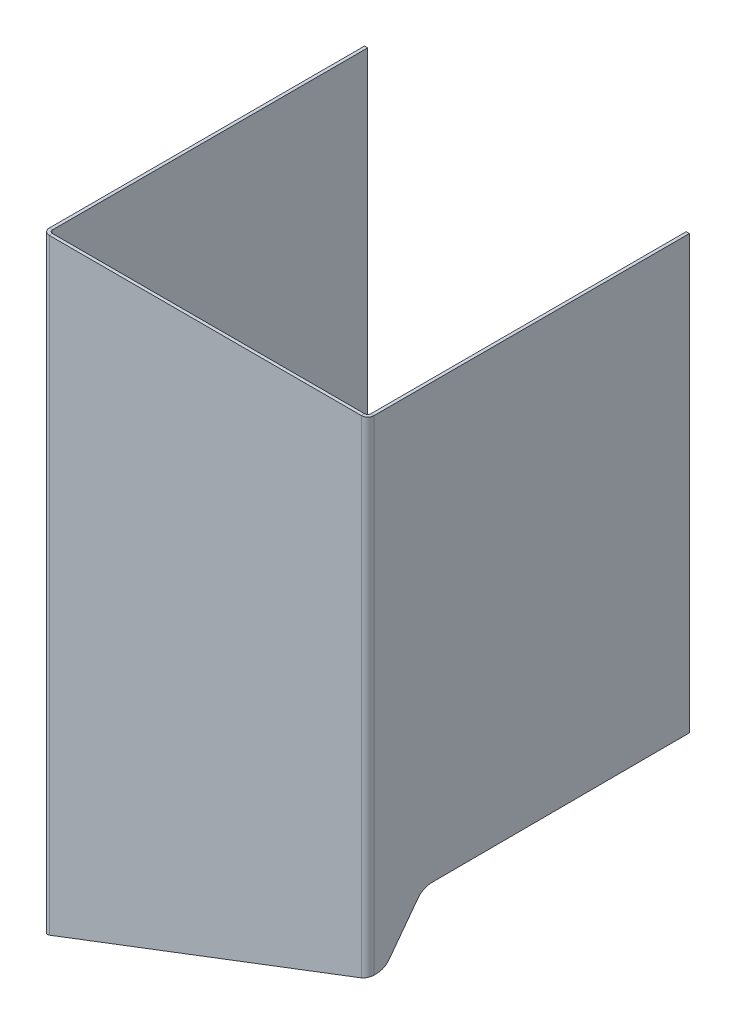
ISO-10303-21;
HEADER;
FILE_DESCRIPTION(('STEP AP214'),'2;1');
FILE_NAME('part.step','',(''),(''),'','','');
FILE_SCHEMA(('AUTOMOTIVE_DESIGN { 1 0 10303 214 1 1 1 1 }'));
ENDSEC;
DATA;
#1=APPLICATION_CONTEXT('core data for automotive mechanical design processes');
#2=APPLICATION_PROTOCOL_DEFINITION('international standard','automotive_design',2000,#1);
#3=PRODUCT_CONTEXT('',#1,'mechanical');
#4=PRODUCT('Part','Part','',(#3));
#5=PRODUCT_RELATED_PRODUCT_CATEGORY('part','',(#4));
#6=PRODUCT_DEFINITION_FORMATION('','',#4);
#7=PRODUCT_DEFINITION_CONTEXT('part definition',#1,'design');
#8=PRODUCT_DEFINITION('design','',#6,#7);
#9=PRODUCT_DEFINITION_SHAPE('','',#8);
#10=(LENGTH_UNIT() NAMED_UNIT(*) SI_UNIT(.MILLI.,.METRE.));
#11=(NAMED_UNIT(*) PLANE_ANGLE_UNIT() SI_UNIT($,.RADIAN.));
#12=(NAMED_UNIT(*) SI_UNIT($,.STERADIAN.) SOLID_ANGLE_UNIT());
#13=UNCERTAINTY_MEASURE_WITH_UNIT(LENGTH_MEASURE(1.E-05),#10,'distance_accuracy_value','');
#14=(GEOMETRIC_REPRESENTATION_CONTEXT(3) GLOBAL_UNCERTAINTY_ASSIGNED_CONTEXT((#13)) GLOBAL_UNIT_ASSIGNED_CONTEXT((#10,
#11,#12)) REPRESENTATION_CONTEXT('',''));
#15=CARTESIAN_POINT('',(0.,0.,0.));
#16=DIRECTION('',(0.,0.,1.));
#17=DIRECTION('',(1.,0.,0.));
#18=AXIS2_PLACEMENT_3D('',#15,#16,#17);
#19=CARTESIAN_POINT('',(98.,500.,2.));
#20=DIRECTION('',(0.,1.,0.));
#21=DIRECTION('',(0.,0.,1.));
#22=AXIS2_PLACEMENT_3D('',#19,#20,#21);
#23=PLANE('',#22);
#24=DIRECTION('',(0.,0.,-1.));
#25=VECTOR('',#24,1.);
#26=CARTESIAN_POINT('',(100.,500.,0.));
#27=LINE('',#26,#25);
#28=CARTESIAN_POINT('',(100.,500.,-2.));
#29=VERTEX_POINT('',#28);
#30=CARTESIAN_POINT('',(100.,500.,-200.));
#31=VERTEX_POINT('',#30);
#32=EDGE_CURVE('E249',#29,#31,#27,.T.);
#33=ORIENTED_EDGE('',*,*,#32,.F.);
#34=DIRECTION('',(1.,0.,0.));
#35=VECTOR('',#34,1.);
#36=CARTESIAN_POINT('',(100.,500.,-2.));
#37=LINE('',#36,#35);
#38=CARTESIAN_POINT('',(102.,500.,-2.));
#39=VERTEX_POINT('',#38);
#40=EDGE_CURVE('E55',#29,#39,#37,.T.);
#41=ORIENTED_EDGE('',*,*,#40,.T.);
#42=DIRECTION('',(0.,0.,-1.));
#43=VECTOR('',#42,1.);
#44=CARTESIAN_POINT('',(102.,500.,0.));
#45=LINE('',#44,#43);
#46=CARTESIAN_POINT('',(102.,500.,-200.));
#47=VERTEX_POINT('',#46);
#48=EDGE_CURVE('E244',#39,#47,#45,.T.);
#49=ORIENTED_EDGE('',*,*,#48,.T.);
#50=DIRECTION('',(1.,0.,0.));
#51=VECTOR('',#50,1.);
#52=CARTESIAN_POINT('',(100.,500.,-200.));
#53=LINE('',#52,#51);
#54=EDGE_CURVE('E246',#31,#47,#53,.T.);
#55=ORIENTED_EDGE('',*,*,#54,.F.);
#56=EDGE_LOOP('',(#33,#41,#49,#55));
#57=FACE_BOUND('',#56,.T.);
#58=ADVANCED_FACE('F32',(#57),#23,.T.);
#59=CARTESIAN_POINT('',(98.,500.,-2.));
#60=DIRECTION('',(0.,-1.,0.));
#61=DIRECTION('',(0.,0.,-1.));
#62=AXIS2_PLACEMENT_3D('',#59,#60,#61);
#63=PLANE('',#62);
#64=DIRECTION('',(0.,0.,1.));
#65=VECTOR('',#64,1.);
#66=CARTESIAN_POINT('',(-102.,500.,-200.));
#67=LINE('',#66,#65);
#68=CARTESIAN_POINT('',(-102.,500.,-200.));
#69=VERTEX_POINT('',#68);
#70=CARTESIAN_POINT('',(-102.,500.,-2.));
#71=VERTEX_POINT('',#70);
#72=EDGE_CURVE('E267',#69,#71,#67,.T.);
#73=ORIENTED_EDGE('',*,*,#72,.T.);
#74=DIRECTION('',(1.,0.,0.));
#75=VECTOR('',#74,1.);
#76=CARTESIAN_POINT('',(-102.,500.,-2.));
#77=LINE('',#76,#75);
#78=CARTESIAN_POINT('',(-100.,500.,-2.));
#79=VERTEX_POINT('',#78);
#80=EDGE_CURVE('E315',#71,#79,#77,.T.);
#81=ORIENTED_EDGE('',*,*,#80,.T.);
#82=DIRECTION('',(0.,0.,1.));
#83=VECTOR('',#82,1.);
#84=CARTESIAN_POINT('',(-100.,500.,-200.));
#85=LINE('',#84,#83);
#86=CARTESIAN_POINT('',(-100.,500.,-200.));
#87=VERTEX_POINT('',#86);
#88=EDGE_CURVE('E261',#87,#79,#85,.T.);
#89=ORIENTED_EDGE('',*,*,#88,.F.);
#90=DIRECTION('',(1.,0.,0.));
#91=VECTOR('',#90,1.);
#92=CARTESIAN_POINT('',(-102.,500.,-200.));
#93=LINE('',#92,#91);
#94=EDGE_CURVE('E264',#69,#87,#93,.T.);
#95=ORIENTED_EDGE('',*,*,#94,.F.);
#96=EDGE_LOOP('',(#73,#81,#89,#95));
#97=FACE_BOUND('',#96,.T.);
#98=ADVANCED_FACE('F375',(#97),#63,.F.);
#99=CARTESIAN_POINT('',(-98.,500.,0.));
#100=DIRECTION('',(0.,1.,0.));
#101=DIRECTION('',(0.,0.,1.));
#102=AXIS2_PLACEMENT_3D('',#99,#100,#101);
#103=PLANE('',#102);
#104=DIRECTION('',(0.,0.,1.));
#105=VECTOR('',#104,1.);
#106=CARTESIAN_POINT('',(-98.,500.,0.));
#107=LINE('',#106,#105);
#108=CARTESIAN_POINT('',(-98.,500.,0.));
#109=VERTEX_POINT('',#108);
#110=CARTESIAN_POINT('',(-98.,500.,2.));
#111=VERTEX_POINT('',#110);
#112=EDGE_CURVE('E317',#109,#111,#107,.T.);
#113=ORIENTED_EDGE('',*,*,#112,.F.);
#114=CARTESIAN_POINT('',(-98.,500.,-2.));
#115=DIRECTION('',(0.,-1.,0.));
#116=DIRECTION('',(0.,0.,-1.));
#117=AXIS2_PLACEMENT_3D('',#114,#115,#116);
#118=CIRCLE('',#117,2.);
#119=EDGE_CURVE('E258',#79,#109,#118,.F.);
#120=ORIENTED_EDGE('',*,*,#119,.F.);
#121=ORIENTED_EDGE('',*,*,#80,.F.);
#122=CARTESIAN_POINT('',(-98.,500.,-2.));
#123=DIRECTION('',(0.,1.,0.));
#124=DIRECTION('',(1.,0.,0.));
#125=AXIS2_PLACEMENT_3D('',#122,#123,#124);
#126=CIRCLE('',#125,4.);
#127=EDGE_CURVE('E270',#71,#111,#126,.T.);
#128=ORIENTED_EDGE('',*,*,#127,.T.);
#129=EDGE_LOOP('',(#113,#120,#121,#128));
#130=FACE_BOUND('',#129,.T.);
#131=ADVANCED_FACE('F34',(#130),#103,.T.);
#132=CARTESIAN_POINT('',(-102.,500.,-2.));
#133=DIRECTION('',(0.,1.,0.));
#134=DIRECTION('',(0.,0.,1.));
#135=AXIS2_PLACEMENT_3D('',#132,#133,#134);
#136=PLANE('',#135);
#137=DIRECTION('',(1.,0.,0.));
#138=VECTOR('',#137,1.);
#139=CARTESIAN_POINT('',(-100.,500.,0.));
#140=LINE('',#139,#138);
#141=CARTESIAN_POINT('',(98.,500.,0.));
#142=VERTEX_POINT('',#141);
#143=EDGE_CURVE('E255',#109,#142,#140,.T.);
#144=ORIENTED_EDGE('',*,*,#143,.F.);
#145=ORIENTED_EDGE('',*,*,#112,.T.);
#146=DIRECTION('',(1.,0.,0.));
#147=VECTOR('',#146,1.);
#148=CARTESIAN_POINT('',(-100.,500.,2.));
#149=LINE('',#148,#147);
#150=CARTESIAN_POINT('',(98.,500.,2.));
#151=VERTEX_POINT('',#150);
#152=EDGE_CURVE('E273',#111,#151,#149,.T.);
#153=ORIENTED_EDGE('',*,*,#152,.T.);
#154=DIRECTION('',(0.,0.,-1.));
#155=VECTOR('',#154,1.);
#156=CARTESIAN_POINT('',(98.,500.,2.));
#157=LINE('',#156,#155);
#158=EDGE_CURVE('E312',#151,#142,#157,.T.);
#159=ORIENTED_EDGE('',*,*,#158,.T.);
#160=EDGE_LOOP('',(#144,#145,#153,#159));
#161=FACE_BOUND('',#160,.T.);
#162=ADVANCED_FACE('F425',(#161),#136,.T.);
#163=CARTESIAN_POINT('',(100.,500.,-2.));
#164=DIRECTION('',(0.,1.,0.));
#165=DIRECTION('',(0.,0.,1.));
#166=AXIS2_PLACEMENT_3D('',#163,#164,#165);
#167=PLANE('',#166);
#168=ORIENTED_EDGE('',*,*,#40,.F.);
#169=CARTESIAN_POINT('',(98.,500.,-2.));
#170=DIRECTION('',(0.,-1.,0.));
#171=DIRECTION('',(0.,0.,-1.));
#172=AXIS2_PLACEMENT_3D('',#169,#170,#171);
#173=CIRCLE('',#172,2.);
#174=EDGE_CURVE('E252',#142,#29,#173,.F.);
#175=ORIENTED_EDGE('',*,*,#174,.F.);
#176=ORIENTED_EDGE('',*,*,#158,.F.);
#177=CARTESIAN_POINT('',(98.,500.,-2.));
#178=DIRECTION('',(0.,1.,0.));
#179=DIRECTION('',(1.,0.,0.));
#180=AXIS2_PLACEMENT_3D('',#177,#178,#179);
#181=CIRCLE('',#180,4.);
#182=EDGE_CURVE('E276',#151,#39,#181,.T.);
#183=ORIENTED_EDGE('',*,*,#182,.T.);
#184=EDGE_LOOP('',(#168,#175,#176,#183));
#185=FACE_BOUND('',#184,.T.);
#186=ADVANCED_FACE('F386',(#185),#167,.T.);
#187=CARTESIAN_POINT('',(98.,500.,-2.));
#188=DIRECTION('',(0.,-1.,0.));
#189=DIRECTION('',(0.,0.,-1.));
#190=AXIS2_PLACEMENT_3D('',#187,#188,#189);
#191=CYLINDRICAL_SURFACE('',#190,4.);
#192=CARTESIAN_POINT('',(98.,194.144163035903,-2.));
#193=DIRECTION('',(0.35630890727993,-0.934363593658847,-0.00293895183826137));
#194=DIRECTION('',(-0.934331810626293,-0.356321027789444,0.00770667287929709));
#195=AXIS2_PLACEMENT_3D('',#192,#193,#194);
#196=ELLIPSE('',#195,4.28098871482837,4.);
#197=CARTESIAN_POINT('',(102.,195.669517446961,-2.));
#198=VERTEX_POINT('',#197);
#199=CARTESIAN_POINT('',(98.,194.13158141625,2.));
#200=VERTEX_POINT('',#199);
#201=EDGE_CURVE('E319',#198,#200,#196,.T.);
#202=ORIENTED_EDGE('',*,*,#201,.F.);
#203=DIRECTION('',(0.,-1.,0.));
#204=VECTOR('',#203,1.);
#205=CARTESIAN_POINT('',(102.,500.,-2.));
#206=LINE('',#205,#204);
#207=EDGE_CURVE('E191',#39,#198,#206,.T.);
#208=ORIENTED_EDGE('',*,*,#207,.F.);
#209=ORIENTED_EDGE('',*,*,#182,.F.);
#210=DIRECTION('',(0.,-1.,0.));
#211=VECTOR('',#210,1.);
#212=CARTESIAN_POINT('',(98.,500.,2.));
#213=LINE('',#212,#211);
#214=EDGE_CURVE('E279',#151,#200,#213,.T.);
#215=ORIENTED_EDGE('',*,*,#214,.T.);
#216=EDGE_LOOP('',(#202,#208,#209,#215));
#217=FACE_BOUND('',#216,.T.);
#218=ADVANCED_FACE('F424',(#217),#191,.T.);
#219=CARTESIAN_POINT('',(-100.,500.,2.));
#220=DIRECTION('',(0.,0.,-1.));
#221=DIRECTION('',(-1.,0.,0.));
#222=AXIS2_PLACEMENT_3D('',#219,#220,#221);
#223=PLANE('',#222);
#224=DIRECTION('',(-0.934367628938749,-0.35631044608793,0.));
#225=VECTOR('',#224,1.);
#226=CARTESIAN_POINT('',(26.9687394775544,167.044619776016,2.));
#227=LINE('',#226,#225);
#228=CARTESIAN_POINT('',(-98.,119.389215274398,2.));
#229=VERTEX_POINT('',#228);
#230=EDGE_CURVE('E359',#200,#229,#227,.T.);
#231=ORIENTED_EDGE('',*,*,#230,.F.);
#232=ORIENTED_EDGE('',*,*,#214,.F.);
#233=ORIENTED_EDGE('',*,*,#152,.F.);
#234=DIRECTION('',(0.,-1.,0.));
#235=VECTOR('',#234,1.);
#236=CARTESIAN_POINT('',(-98.,500.,2.));
#237=LINE('',#236,#235);
#238=EDGE_CURVE('E282',#111,#229,#237,.T.);
#239=ORIENTED_EDGE('',*,*,#238,.T.);
#240=EDGE_LOOP('',(#231,#232,#233,#239));
#241=FACE_BOUND('',#240,.T.);
#242=ADVANCED_FACE('F433',(#241),#223,.F.);
#243=CARTESIAN_POINT('',(-98.,500.,-2.));
#244=DIRECTION('',(0.,-1.,0.));
#245=DIRECTION('',(0.,0.,-1.));
#246=AXIS2_PLACEMENT_3D('',#243,#244,#245);
#247=CYLINDRICAL_SURFACE('',#246,4.);
#248=CARTESIAN_POINT('',(-98.,119.401796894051,-2.));
#249=DIRECTION('',(0.35630890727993,-0.934363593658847,-0.00293895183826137));
#250=DIRECTION('',(-0.934331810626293,-0.356321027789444,0.00770667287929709));
#251=AXIS2_PLACEMENT_3D('',#248,#249,#250);
#252=ELLIPSE('',#251,4.28098871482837,4.);
#253=CARTESIAN_POINT('',(-102.,117.876442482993,-2.));
#254=VERTEX_POINT('',#253);
#255=EDGE_CURVE('E198',#229,#254,#252,.T.);
#256=ORIENTED_EDGE('',*,*,#255,.F.);
#257=ORIENTED_EDGE('',*,*,#238,.F.);
#258=ORIENTED_EDGE('',*,*,#127,.F.);
#259=DIRECTION('',(0.,-1.,0.));
#260=VECTOR('',#259,1.);
#261=CARTESIAN_POINT('',(-102.,500.,-2.));
#262=LINE('',#261,#260);
#263=EDGE_CURVE('E285',#71,#254,#262,.T.);
#264=ORIENTED_EDGE('',*,*,#263,.T.);
#265=EDGE_LOOP('',(#256,#257,#258,#264));
#266=FACE_BOUND('',#265,.T.);
#267=ADVANCED_FACE('F368',(#266),#247,.T.);
#268=CARTESIAN_POINT('',(-102.,500.,-200.));
#269=DIRECTION('',(1.,0.,0.));
#270=DIRECTION('',(0.,0.,-1.));
#271=AXIS2_PLACEMENT_3D('',#268,#269,#270);
#272=PLANE('',#271);
#273=DIRECTION('',(0.,0.00314538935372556,-0.999995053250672));
#274=VECTOR('',#273,1.);
#275=CARTESIAN_POINT('',(-102.,118.503007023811,-201.199962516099));
#276=LINE('',#275,#274);
#277=CARTESIAN_POINT('',(-102.,118.232611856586,-115.234824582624));
#278=VERTEX_POINT('',#277);
#279=EDGE_CURVE('E193',#254,#278,#276,.T.);
#280=ORIENTED_EDGE('',*,*,#279,.F.);
#281=ORIENTED_EDGE('',*,*,#263,.F.);
#282=ORIENTED_EDGE('',*,*,#72,.F.);
#283=DIRECTION('',(0.,-1.,0.));
#284=VECTOR('',#283,1.);
#285=CARTESIAN_POINT('',(-102.,500.,-200.));
#286=LINE('',#285,#284);
#287=CARTESIAN_POINT('',(-102.,150.60664801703,-200.));
#288=VERTEX_POINT('',#287);
#289=EDGE_CURVE('E288',#69,#288,#286,.T.);
#290=ORIENTED_EDGE('',*,*,#289,.T.);
#291=DIRECTION('',(0.,0.00314538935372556,-0.999995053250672));
#292=VECTOR('',#291,1.);
#293=CARTESIAN_POINT('',(-102.,150.610104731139,-201.09897269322));
#294=LINE('',#293,#292);
#295=CARTESIAN_POINT('',(-102.,150.450613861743,-150.392982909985));
#296=VERTEX_POINT('',#295);
#297=EDGE_CURVE('E11',#296,#288,#294,.T.);
#298=ORIENTED_EDGE('',*,*,#297,.F.);
#299=CARTESIAN_POINT('',(-102.,137.615118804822,-152.768221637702));
#300=DIRECTION('',(1.,0.,0.));
#301=DIRECTION('',(0.,-0.569957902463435,-0.82167389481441));
#302=AXIS2_PLACEMENT_3D('',#299,#300,#301);
#303=ELLIPSE('',#302,14.418063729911,12.);
#304=CARTESIAN_POINT('',(-102.,146.125248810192,-141.132044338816));
#305=VERTEX_POINT('',#304);
#306=EDGE_CURVE('E40',#305,#296,#303,.F.);
#307=ORIENTED_EDGE('',*,*,#306,.F.);
#308=DIRECTION('',(0.,0.800574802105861,-0.59923283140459));
#309=VECTOR('',#308,1.);
#310=CARTESIAN_POINT('',(-102.,401.1714251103,-332.034933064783));
#311=LINE('',#310,#309);
#312=CARTESIAN_POINT('',(-102.,121.837082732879,-122.95227339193));
#313=VERTEX_POINT('',#312);
#314=EDGE_CURVE('E323',#313,#305,#311,.T.);
#315=ORIENTED_EDGE('',*,*,#314,.F.);
#316=CARTESIAN_POINT('',(-102.,128.928857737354,-113.255458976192));
#317=DIRECTION('',(1.,0.,0.));
#318=DIRECTION('',(0.,-0.569957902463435,-0.82167389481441));
#319=AXIS2_PLACEMENT_3D('',#316,#317,#318);
#320=ELLIPSE('',#319,12.0150531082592,10.);
#321=EDGE_CURVE('E321',#278,#313,#320,.T.);
#322=ORIENTED_EDGE('',*,*,#321,.F.);
#323=EDGE_LOOP('',(#280,#281,#282,#290,#298,#307,#315,#322));
#324=FACE_BOUND('',#323,.T.);
#325=ADVANCED_FACE('F342',(#324),#272,.F.);
#326=CARTESIAN_POINT('',(-102.,500.,-200.));
#327=DIRECTION('',(0.,0.,-1.));
#328=DIRECTION('',(-1.,0.,0.));
#329=AXIS2_PLACEMENT_3D('',#326,#327,#328);
#330=PLANE('',#329);
#331=DIRECTION('',(0.,-1.,0.));
#332=VECTOR('',#331,1.);
#333=CARTESIAN_POINT('',(-100.,500.,-200.));
#334=LINE('',#333,#332);
#335=CARTESIAN_POINT('',(-100.,151.369325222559,-200.));
#336=VERTEX_POINT('',#335);
#337=EDGE_CURVE('E291',#87,#336,#334,.T.);
#338=ORIENTED_EDGE('',*,*,#337,.T.);
#339=DIRECTION('',(-0.934367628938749,-0.35631044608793,0.));
#340=VECTOR('',#339,1.);
#341=CARTESIAN_POINT('',(14.321763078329,194.964626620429,-200.));
#342=LINE('',#341,#340);
#343=EDGE_CURVE('E230',#336,#288,#342,.T.);
#344=ORIENTED_EDGE('',*,*,#343,.T.);
#345=ORIENTED_EDGE('',*,*,#289,.F.);
#346=ORIENTED_EDGE('',*,*,#94,.T.);
#347=EDGE_LOOP('',(#338,#344,#345,#346));
#348=FACE_BOUND('',#347,.T.);
#349=ADVANCED_FACE('F347',(#348),#330,.T.);
#350=CARTESIAN_POINT('',(-100.,500.,-200.));
#351=DIRECTION('',(1.,0.,0.));
#352=DIRECTION('',(0.,0.,-1.));
#353=AXIS2_PLACEMENT_3D('',#350,#351,#352);
#354=PLANE('',#353);
#355=DIRECTION('',(0.,-1.,0.));
#356=VECTOR('',#355,1.);
#357=CARTESIAN_POINT('',(-100.,500.,-2.));
#358=LINE('',#357,#356);
#359=CARTESIAN_POINT('',(-100.,118.639119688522,-2.));
#360=VERTEX_POINT('',#359);
#361=EDGE_CURVE('E294',#79,#360,#358,.T.);
#362=ORIENTED_EDGE('',*,*,#361,.T.);
#363=DIRECTION('',(0.,0.00314538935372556,-0.999995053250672));
#364=VECTOR('',#363,1.);
#365=CARTESIAN_POINT('',(-100.,119.265676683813,-201.197563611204));
#366=LINE('',#365,#364);
#367=CARTESIAN_POINT('',(-100.,118.991846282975,-114.140282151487));
#368=VERTEX_POINT('',#367);
#369=EDGE_CURVE('E192',#360,#368,#366,.T.);
#370=ORIENTED_EDGE('',*,*,#369,.T.);
#371=CARTESIAN_POINT('',(-100.,129.688092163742,-112.160916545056));
#372=DIRECTION('',(1.,0.,0.));
#373=DIRECTION('',(0.,-0.569957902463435,-0.82167389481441));
#374=AXIS2_PLACEMENT_3D('',#371,#372,#373);
#375=ELLIPSE('',#374,12.0150531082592,10.);
#376=CARTESIAN_POINT('',(-100.,122.596317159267,-121.857730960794));
#377=VERTEX_POINT('',#376);
#378=EDGE_CURVE('E211',#368,#377,#375,.T.);
#379=ORIENTED_EDGE('',*,*,#378,.T.);
#380=DIRECTION('',(0.,0.800574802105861,-0.59923283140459));
#381=VECTOR('',#380,1.);
#382=CARTESIAN_POINT('',(-100.,401.969136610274,-330.969190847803));
#383=LINE('',#382,#381);
#384=CARTESIAN_POINT('',(-100.,146.88448323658,-140.03750190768));
#385=VERTEX_POINT('',#384);
#386=EDGE_CURVE('E178',#377,#385,#383,.T.);
#387=ORIENTED_EDGE('',*,*,#386,.T.);
#388=CARTESIAN_POINT('',(-100.,138.374353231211,-151.673679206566));
#389=DIRECTION('',(1.,0.,0.));
#390=DIRECTION('',(0.,-0.569957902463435,-0.82167389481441));
#391=AXIS2_PLACEMENT_3D('',#388,#389,#390);
#392=ELLIPSE('',#391,14.418063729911,12.);
#393=CARTESIAN_POINT('',(-100.,151.209848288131,-149.298440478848));
#394=VERTEX_POINT('',#393);
#395=EDGE_CURVE('E222',#385,#394,#392,.F.);
#396=ORIENTED_EDGE('',*,*,#395,.T.);
#397=DIRECTION('',(0.,0.00314538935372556,-0.999995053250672));
#398=VECTOR('',#397,1.);
#399=CARTESIAN_POINT('',(-100.,151.37277439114,-201.096573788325));
#400=LINE('',#399,#398);
#401=EDGE_CURVE('E233',#394,#336,#400,.T.);
#402=ORIENTED_EDGE('',*,*,#401,.T.);
#403=ORIENTED_EDGE('',*,*,#337,.F.);
#404=ORIENTED_EDGE('',*,*,#88,.T.);
#405=EDGE_LOOP('',(#362,#370,#379,#387,#396,#402,#403,#404));
#406=FACE_BOUND('',#405,.T.);
#407=ADVANCED_FACE('F349',(#406),#354,.T.);
#408=CARTESIAN_POINT('',(-98.,500.,-2.));
#409=DIRECTION('',(0.,-1.,0.));
#410=DIRECTION('',(0.,0.,-1.));
#411=AXIS2_PLACEMENT_3D('',#408,#409,#410);
#412=CYLINDRICAL_SURFACE('',#411,2.);
#413=DIRECTION('',(0.,-1.,0.));
#414=VECTOR('',#413,1.);
#415=CARTESIAN_POINT('',(-98.,500.,0.));
#416=LINE('',#415,#414);
#417=CARTESIAN_POINT('',(-98.,119.395506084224,0.));
#418=VERTEX_POINT('',#417);
#419=EDGE_CURVE('E297',#109,#418,#416,.T.);
#420=ORIENTED_EDGE('',*,*,#419,.T.);
#421=CARTESIAN_POINT('',(-98.,119.401796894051,-2.));
#422=DIRECTION('',(0.35630890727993,-0.934363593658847,-0.00293895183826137));
#423=DIRECTION('',(-0.934331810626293,-0.356321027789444,0.00770667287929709));
#424=AXIS2_PLACEMENT_3D('',#421,#422,#423);
#425=ELLIPSE('',#424,2.14049435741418,2.);
#426=EDGE_CURVE('E196',#418,#360,#425,.T.);
#427=ORIENTED_EDGE('',*,*,#426,.T.);
#428=ORIENTED_EDGE('',*,*,#361,.F.);
#429=ORIENTED_EDGE('',*,*,#119,.T.);
#430=EDGE_LOOP('',(#420,#427,#428,#429));
#431=FACE_BOUND('',#430,.T.);
#432=ADVANCED_FACE('F377',(#431),#412,.F.);
#433=CARTESIAN_POINT('',(-100.,500.,0.));
#434=DIRECTION('',(0.,0.,-1.));
#435=DIRECTION('',(-1.,0.,0.));
#436=AXIS2_PLACEMENT_3D('',#433,#434,#435);
#437=PLANE('',#436);
#438=DIRECTION('',(0.,-1.,0.));
#439=VECTOR('',#438,1.);
#440=CARTESIAN_POINT('',(98.,500.,0.));
#441=LINE('',#440,#439);
#442=CARTESIAN_POINT('',(98.,194.137872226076,0.));
#443=VERTEX_POINT('',#442);
#444=EDGE_CURVE('E300',#142,#443,#441,.T.);
#445=ORIENTED_EDGE('',*,*,#444,.T.);
#446=DIRECTION('',(-0.934367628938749,-0.35631044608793,0.));
#447=VECTOR('',#446,1.);
#448=CARTESIAN_POINT('',(26.9666451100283,167.050111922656,0.));
#449=LINE('',#448,#447);
#450=EDGE_CURVE('E204',#443,#418,#449,.T.);
#451=ORIENTED_EDGE('',*,*,#450,.T.);
#452=ORIENTED_EDGE('',*,*,#419,.F.);
#453=ORIENTED_EDGE('',*,*,#143,.T.);
#454=EDGE_LOOP('',(#445,#451,#452,#453));
#455=FACE_BOUND('',#454,.T.);
#456=ADVANCED_FACE('F379',(#455),#437,.T.);
#457=CARTESIAN_POINT('',(98.,500.,-2.));
#458=DIRECTION('',(0.,-1.,0.));
#459=DIRECTION('',(0.,0.,-1.));
#460=AXIS2_PLACEMENT_3D('',#457,#458,#459);
#461=CYLINDRICAL_SURFACE('',#460,2.);
#462=DIRECTION('',(0.,-1.,0.));
#463=VECTOR('',#462,1.);
#464=CARTESIAN_POINT('',(100.,500.,-2.));
#465=LINE('',#464,#463);
#466=CARTESIAN_POINT('',(100.,194.906840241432,-2.));
#467=VERTEX_POINT('',#466);
#468=EDGE_CURVE('E303',#29,#467,#465,.T.);
#469=ORIENTED_EDGE('',*,*,#468,.T.);
#470=CARTESIAN_POINT('',(98.,194.144163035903,-2.));
#471=DIRECTION('',(0.35630890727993,-0.934363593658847,-0.00293895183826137));
#472=DIRECTION('',(-0.934331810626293,-0.356321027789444,0.00770667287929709));
#473=AXIS2_PLACEMENT_3D('',#470,#471,#472);
#474=ELLIPSE('',#473,2.14049435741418,2.);
#475=EDGE_CURVE('E207',#467,#443,#474,.T.);
#476=ORIENTED_EDGE('',*,*,#475,.T.);
#477=ORIENTED_EDGE('',*,*,#444,.F.);
#478=ORIENTED_EDGE('',*,*,#174,.T.);
#479=EDGE_LOOP('',(#469,#476,#477,#478));
#480=FACE_BOUND('',#479,.T.);
#481=ADVANCED_FACE('F384',(#480),#461,.F.);
#482=CARTESIAN_POINT('',(100.,500.,0.));
#483=DIRECTION('',(-1.,0.,0.));
#484=DIRECTION('',(0.,0.,1.));
#485=AXIS2_PLACEMENT_3D('',#482,#483,#484);
#486=PLANE('',#485);
#487=CARTESIAN_POINT('',(100.,205.611534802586,-2.70667343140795));
#488=DIRECTION('',(-1.,0.,0.));
#489=DIRECTION('',(0.,-0.569957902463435,-0.82167389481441));
#490=AXIS2_PLACEMENT_3D('',#487,#488,#489);
#491=ELLIPSE('',#490,12.0150531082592,10.);
#492=CARTESIAN_POINT('',(100.,198.519759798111,-12.4034878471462));
#493=VERTEX_POINT('',#492);
#494=CARTESIAN_POINT('',(100.,194.915288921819,-4.68603903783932));
#495=VERTEX_POINT('',#494);
#496=EDGE_CURVE('E179',#493,#495,#491,.T.);
#497=ORIENTED_EDGE('',*,*,#496,.T.);
#498=DIRECTION('',(0.,-0.00314538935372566,0.999995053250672));
#499=VECTOR('',#498,1.);
#500=CARTESIAN_POINT('',(100.,194.903567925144,-0.959651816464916));
#501=LINE('',#500,#499);
#502=EDGE_CURVE('E183',#495,#467,#501,.T.);
#503=ORIENTED_EDGE('',*,*,#502,.T.);
#504=ORIENTED_EDGE('',*,*,#468,.F.);
#505=ORIENTED_EDGE('',*,*,#32,.T.);
#506=DIRECTION('',(0.,-1.,0.));
#507=VECTOR('',#506,1.);
#508=CARTESIAN_POINT('',(100.,500.,-200.));
#509=LINE('',#508,#507);
#510=CARTESIAN_POINT('',(100.,227.637045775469,-200.));
#511=VERTEX_POINT('',#510);
#512=EDGE_CURVE('E306',#31,#511,#509,.T.);
#513=ORIENTED_EDGE('',*,*,#512,.T.);
#514=DIRECTION('',(0.,-0.00314538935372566,0.999995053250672));
#515=VECTOR('',#514,1.);
#516=CARTESIAN_POINT('',(100.,227.010665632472,-0.858661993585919));
#517=LINE('',#516,#515);
#518=CARTESIAN_POINT('',(100.,227.133290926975,-39.8441973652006));
#519=VERTEX_POINT('',#518);
#520=EDGE_CURVE('E236',#511,#519,#517,.T.);
#521=ORIENTED_EDGE('',*,*,#520,.T.);
#522=CARTESIAN_POINT('',(100.,214.297795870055,-42.2194360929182));
#523=DIRECTION('',(-1.,0.,0.));
#524=DIRECTION('',(0.,-0.569957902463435,-0.82167389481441));
#525=AXIS2_PLACEMENT_3D('',#522,#523,#524);
#526=ELLIPSE('',#525,14.418063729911,12.);
#527=CARTESIAN_POINT('',(100.,222.807925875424,-30.5832587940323));
#528=VERTEX_POINT('',#527);
#529=EDGE_CURVE('E225',#519,#528,#526,.F.);
#530=ORIENTED_EDGE('',*,*,#529,.T.);
#531=DIRECTION('',(0.,-0.800574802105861,0.59923283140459));
#532=VECTOR('',#531,1.);
#533=CARTESIAN_POINT('',(100.,385.794145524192,-152.578971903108));
#534=LINE('',#533,#532);
#535=EDGE_CURVE('E217',#528,#493,#534,.T.);
#536=ORIENTED_EDGE('',*,*,#535,.T.);
#537=EDGE_LOOP('',(#497,#503,#504,#505,#513,#521,#530,#536));
#538=FACE_BOUND('',#537,.T.);
#539=ADVANCED_FACE('F390',(#538),#486,.T.);
#540=CARTESIAN_POINT('',(100.,500.,-200.));
#541=DIRECTION('',(0.,0.,-1.));
#542=DIRECTION('',(-1.,0.,0.));
#543=AXIS2_PLACEMENT_3D('',#540,#541,#542);
#544=PLANE('',#543);
#545=DIRECTION('',(0.,-1.,0.));
#546=VECTOR('',#545,1.);
#547=CARTESIAN_POINT('',(102.,500.,-200.));
#548=LINE('',#547,#546);
#549=CARTESIAN_POINT('',(102.,228.399722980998,-200.));
#550=VERTEX_POINT('',#549);
#551=EDGE_CURVE('E309',#47,#550,#548,.T.);
#552=ORIENTED_EDGE('',*,*,#551,.T.);
#553=DIRECTION('',(-0.934367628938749,-0.35631044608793,0.));
#554=VECTOR('',#553,1.);
#555=CARTESIAN_POINT('',(190.67642201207,262.215465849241,-200.));
#556=LINE('',#555,#554);
#557=EDGE_CURVE('E239',#550,#511,#556,.T.);
#558=ORIENTED_EDGE('',*,*,#557,.T.);
#559=ORIENTED_EDGE('',*,*,#512,.F.);
#560=ORIENTED_EDGE('',*,*,#54,.T.);
#561=EDGE_LOOP('',(#552,#558,#559,#560));
#562=FACE_BOUND('',#561,.T.);
#563=ADVANCED_FACE('F394',(#562),#544,.T.);
#564=CARTESIAN_POINT('',(102.,500.,0.));
#565=DIRECTION('',(-1.,0.,0.));
#566=DIRECTION('',(0.,0.,1.));
#567=AXIS2_PLACEMENT_3D('',#564,#565,#566);
#568=PLANE('',#567);
#569=DIRECTION('',(0.,-0.00314538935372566,0.999995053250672));
#570=VECTOR('',#569,1.);
#571=CARTESIAN_POINT('',(102.,195.666237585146,-0.957252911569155));
#572=LINE('',#571,#570);
#573=CARTESIAN_POINT('',(102.,195.674523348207,-3.59149660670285));
#574=VERTEX_POINT('',#573);
#575=EDGE_CURVE('E47',#574,#198,#572,.T.);
#576=ORIENTED_EDGE('',*,*,#575,.F.);
#577=CARTESIAN_POINT('',(102.,206.370769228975,-1.61213100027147));
#578=DIRECTION('',(-1.,0.,0.));
#579=DIRECTION('',(0.,-0.569957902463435,-0.82167389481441));
#580=AXIS2_PLACEMENT_3D('',#577,#578,#579);
#581=ELLIPSE('',#580,12.0150531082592,10.);
#582=CARTESIAN_POINT('',(102.,199.2789942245,-11.3089454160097));
#583=VERTEX_POINT('',#582);
#584=EDGE_CURVE('E170',#583,#574,#581,.T.);
#585=ORIENTED_EDGE('',*,*,#584,.F.);
#586=DIRECTION('',(0.,-0.800574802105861,0.59923283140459));
#587=VECTOR('',#586,1.);
#588=CARTESIAN_POINT('',(102.,386.591857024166,-151.513229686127));
#589=LINE('',#588,#587);
#590=CARTESIAN_POINT('',(102.,223.567160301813,-29.4887163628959));
#591=VERTEX_POINT('',#590);
#592=EDGE_CURVE('E220',#591,#583,#589,.T.);
#593=ORIENTED_EDGE('',*,*,#592,.F.);
#594=CARTESIAN_POINT('',(102.,215.057030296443,-41.1248936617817));
#595=DIRECTION('',(-1.,0.,0.));
#596=DIRECTION('',(0.,-0.569957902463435,-0.82167389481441));
#597=AXIS2_PLACEMENT_3D('',#594,#595,#596);
#598=ELLIPSE('',#597,14.418063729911,12.);
#599=CARTESIAN_POINT('',(102.,227.892525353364,-38.7496549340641));
#600=VERTEX_POINT('',#599);
#601=EDGE_CURVE('E228',#600,#591,#598,.F.);
#602=ORIENTED_EDGE('',*,*,#601,.F.);
#603=DIRECTION('',(0.,-0.00314538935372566,0.999995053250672));
#604=VECTOR('',#603,1.);
#605=CARTESIAN_POINT('',(102.,227.773335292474,-0.856263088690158));
#606=LINE('',#605,#604);
#607=EDGE_CURVE('E242',#550,#600,#606,.T.);
#608=ORIENTED_EDGE('',*,*,#607,.F.);
#609=ORIENTED_EDGE('',*,*,#551,.F.);
#610=ORIENTED_EDGE('',*,*,#48,.F.);
#611=ORIENTED_EDGE('',*,*,#207,.T.);
#612=EDGE_LOOP('',(#576,#585,#593,#602,#608,#609,#610,#611));
#613=FACE_BOUND('',#612,.T.);
#614=ADVANCED_FACE('F188',(#613),#568,.F.);
#615=CARTESIAN_POINT('',(317.102535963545,310.416116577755,-196.659597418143));
#616=DIRECTION('',(0.35630890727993,-0.934363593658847,-0.00293895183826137));
#617=DIRECTION('',(0.424662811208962,0.164740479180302,-0.890237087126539));
#618=AXIS2_PLACEMENT_3D('',#615,#616,#617);
#619=PLANE('',#618);
#620=ORIENTED_EDGE('',*,*,#607,.T.);
#621=DIRECTION('',(-0.83228928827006,-0.315951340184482,-0.45548797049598));
#622=VECTOR('',#621,1.);
#623=CARTESIAN_POINT('',(212.840039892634,269.969312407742,21.9099084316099));
#624=LINE('',#623,#622);
#625=EDGE_CURVE('E338',#600,#519,#624,.T.);
#626=ORIENTED_EDGE('',*,*,#625,.T.);
#627=ORIENTED_EDGE('',*,*,#520,.F.);
#628=ORIENTED_EDGE('',*,*,#557,.F.);
#629=EDGE_LOOP('',(#620,#626,#627,#628));
#630=FACE_BOUND('',#629,.T.);
#631=ADVANCED_FACE('F397',(#630),#619,.T.);
#632=CARTESIAN_POINT('',(217.115746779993,258.756949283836,21.8746410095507));
#633=DIRECTION('',(-0.83228928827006,-0.315951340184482,-0.45548797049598));
#634=DIRECTION('',(0.35630890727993,-0.934363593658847,-0.00293895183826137));
#635=AXIS2_PLACEMENT_3D('',#632,#633,#634);
#636=CYLINDRICAL_SURFACE('',#635,12.);
#637=ORIENTED_EDGE('',*,*,#601,.T.);
#638=DIRECTION('',(-0.83228928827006,-0.315951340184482,-0.45548797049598));
#639=VECTOR('',#638,1.);
#640=CARTESIAN_POINT('',(210.466649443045,264.742967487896,29.8719587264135));
#641=LINE('',#640,#639);
#642=EDGE_CURVE('E339',#591,#528,#641,.T.);
#643=ORIENTED_EDGE('',*,*,#642,.T.);
#644=ORIENTED_EDGE('',*,*,#529,.F.);
#645=ORIENTED_EDGE('',*,*,#625,.F.);
#646=EDGE_LOOP('',(#637,#643,#644,#645));
#647=FACE_BOUND('',#646,.T.);
#648=ADVANCED_FACE('F402',(#647),#636,.F.);
#649=EDGE_CURVE('E332',#385,#305,#641,.T.);
#650=ORIENTED_EDGE('',*,*,#649,.T.);
#651=ORIENTED_EDGE('',*,*,#306,.T.);
#652=EDGE_CURVE('E330',#394,#296,#624,.T.);
#653=ORIENTED_EDGE('',*,*,#652,.F.);
#654=ORIENTED_EDGE('',*,*,#395,.F.);
#655=EDGE_LOOP('',(#650,#651,#653,#654));
#656=FACE_BOUND('',#655,.T.);
#657=ADVANCED_FACE('F329',(#656),#636,.F.);
#658=CARTESIAN_POINT('',(210.541268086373,268.359939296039,27.2266827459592));
#659=DIRECTION('',(0.55409144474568,-0.498834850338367,-0.666443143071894));
#660=DIRECTION('',(0.0166496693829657,0.807055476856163,-0.590240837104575));
#661=AXIS2_PLACEMENT_3D('',#658,#659,#660);
#662=PLANE('',#661);
#663=ORIENTED_EDGE('',*,*,#592,.T.);
#664=DIRECTION('',(-0.83228928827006,-0.315951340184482,-0.45548797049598));
#665=VECTOR('',#664,1.);
#666=CARTESIAN_POINT('',(209.961625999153,240.263085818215,47.77534487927));
#667=LINE('',#666,#665);
#668=EDGE_CURVE('E175',#583,#493,#667,.T.);
#669=ORIENTED_EDGE('',*,*,#668,.T.);
#670=ORIENTED_EDGE('',*,*,#535,.F.);
#671=ORIENTED_EDGE('',*,*,#642,.F.);
#672=EDGE_LOOP('',(#663,#669,#670,#671));
#673=FACE_BOUND('',#672,.T.);
#674=ADVANCED_FACE('F405',(#673),#662,.T.);
#675=EDGE_CURVE('E184',#377,#313,#667,.T.);
#676=ORIENTED_EDGE('',*,*,#675,.T.);
#677=ORIENTED_EDGE('',*,*,#314,.T.);
#678=ORIENTED_EDGE('',*,*,#649,.F.);
#679=ORIENTED_EDGE('',*,*,#386,.F.);
#680=EDGE_LOOP('',(#676,#677,#678,#679));
#681=FACE_BOUND('',#680,.T.);
#682=ADVANCED_FACE('F353',(#681),#662,.T.);
#683=CARTESIAN_POINT('',(204.420711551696,245.251434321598,54.439776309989));
#684=DIRECTION('',(-0.83228928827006,-0.315951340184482,-0.45548797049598));
#685=DIRECTION('',(0.35630890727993,-0.934363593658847,-0.00293895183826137));
#686=AXIS2_PLACEMENT_3D('',#683,#684,#685);
#687=CYLINDRICAL_SURFACE('',#686,10.);
#688=ORIENTED_EDGE('',*,*,#584,.T.);
#689=DIRECTION('',(-0.83228928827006,-0.315951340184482,-0.45548797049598));
#690=VECTOR('',#689,1.);
#691=CARTESIAN_POINT('',(207.983800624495,235.90779838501,54.4103867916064));
#692=LINE('',#691,#690);
#693=EDGE_CURVE('E172',#574,#495,#692,.T.);
#694=ORIENTED_EDGE('',*,*,#693,.T.);
#695=ORIENTED_EDGE('',*,*,#496,.F.);
#696=ORIENTED_EDGE('',*,*,#668,.F.);
#697=EDGE_LOOP('',(#688,#694,#695,#696));
#698=FACE_BOUND('',#697,.T.);
#699=ADVANCED_FACE('F171',(#698),#687,.T.);
#700=EDGE_CURVE('E185',#368,#278,#692,.T.);
#701=ORIENTED_EDGE('',*,*,#700,.T.);
#702=ORIENTED_EDGE('',*,*,#321,.T.);
#703=ORIENTED_EDGE('',*,*,#675,.F.);
#704=ORIENTED_EDGE('',*,*,#378,.F.);
#705=EDGE_LOOP('',(#701,#702,#703,#704));
#706=FACE_BOUND('',#705,.T.);
#707=ADVANCED_FACE('F473',(#706),#687,.T.);
#708=CARTESIAN_POINT('',(210.267648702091,236.793777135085,49.6226676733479));
#709=DIRECTION('',(0.35630890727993,-0.934363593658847,-0.00293895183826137));
#710=DIRECTION('',(0.424662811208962,0.164740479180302,-0.890237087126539));
#711=AXIS2_PLACEMENT_3D('',#708,#709,#710);
#712=PLANE('',#711);
#713=ORIENTED_EDGE('',*,*,#693,.F.);
#714=ORIENTED_EDGE('',*,*,#575,.T.);
#715=ORIENTED_EDGE('',*,*,#201,.T.);
#716=ORIENTED_EDGE('',*,*,#230,.T.);
#717=ORIENTED_EDGE('',*,*,#255,.T.);
#718=ORIENTED_EDGE('',*,*,#279,.T.);
#719=ORIENTED_EDGE('',*,*,#700,.F.);
#720=ORIENTED_EDGE('',*,*,#369,.F.);
#721=ORIENTED_EDGE('',*,*,#426,.F.);
#722=ORIENTED_EDGE('',*,*,#450,.F.);
#723=ORIENTED_EDGE('',*,*,#475,.F.);
#724=ORIENTED_EDGE('',*,*,#502,.F.);
#725=EDGE_LOOP('',(#713,#714,#715,#716,#717,#718,#719,#720,#721,#722,#723,#724));
#726=FACE_BOUND('',#725,.T.);
#727=ADVANCED_FACE('F181',(#726),#712,.T.);
#728=ORIENTED_EDGE('',*,*,#652,.T.);
#729=ORIENTED_EDGE('',*,*,#297,.T.);
#730=ORIENTED_EDGE('',*,*,#343,.F.);
#731=ORIENTED_EDGE('',*,*,#401,.F.);
#732=EDGE_LOOP('',(#728,#729,#730,#731));
#733=FACE_BOUND('',#732,.T.);
#734=ADVANCED_FACE('F337',(#733),#619,.T.);
#735=CLOSED_SHELL('',(#58,#98,#131,#162,#186,#218,#242,#267,#325,#349,#407,#432,#456,#481,#539,
#563,#614,#631,#648,#657,#674,#682,#699,#707,#727,#734));
#736=MANIFOLD_SOLID_BREP('B2',#735);
#737=ADVANCED_BREP_SHAPE_REPRESENTATION('',(#18,#736),#14);
#738=SHAPE_DEFINITION_REPRESENTATION(#9,#737);
ENDSEC;
END-ISO-10303-21;
